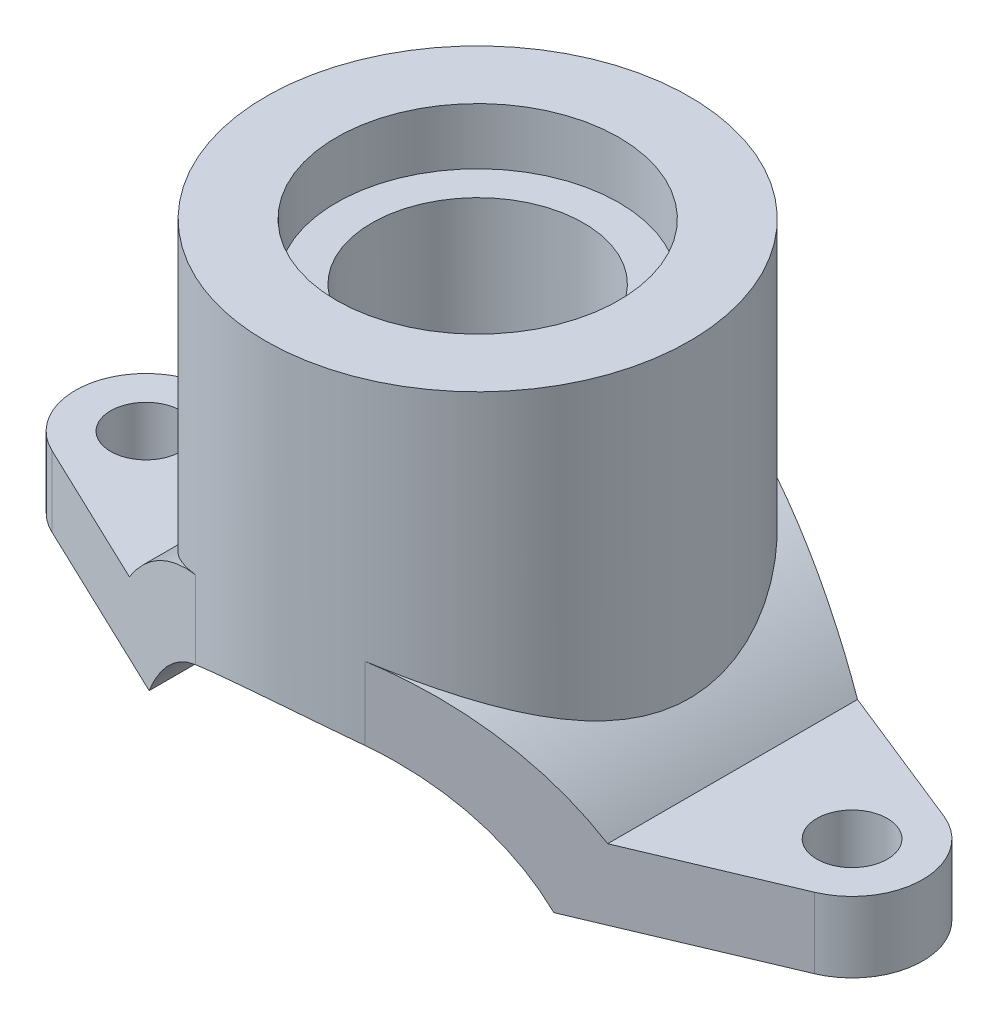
from build123d import *

# Parameters (mm, degrees)
BOSS_EXTRUDE1_DEPTH = 75
SKETCH3_OUTSIDE_W   = 370.368
SKETCH3_OUTSIDE_H   = 220.368
CUT_EXTRUDE1_DEPTH  = 223.162102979
BOSS_EXTRUDE2_REACH = 227
SKETCH4_R           = 75
SKETCH6_R           = 12.5
CUT_EXTRUDE2_DEPTH  = 210.165006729


with BuildPart() as part:
    # Sketch2 → Boss-Extrude1 (new, symmetric)
    with BuildSketch(Plane.XY):
        with BuildLine():
            Line((-150, 0), (-69.84983894, 0))
            ThreePointArc((-69.84983894, 0), (0, 41), (69.84983894, 0))
            Line((69.84983894, 0), (150, 0))
            Line((150, 0), (150, 25))
            Line((150, 25), (83.240615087, 25))
            ThreePointArc((83.240615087, 25), (0, 66), (-83.240615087, 25))
            Line((-83.240615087, 25), (-150, 25))
            Line((-150, 25), (-150, 0))
        make_face()
    extrude(amount=BOSS_EXTRUDE1_DEPTH, both=True)

    # Sketch3 outside → Cut-Extrude1 (cut, through all)
    with BuildSketch(Plane(origin=(0, 66, 75), x_dir=(1, 0, 0), z_dir=(0, 1, 0))):
        with Locations((0, 75)):
            Rectangle(SKETCH3_OUTSIDE_W, SKETCH3_OUTSIDE_H)
        with BuildLine():
            Line((-135.30373924, 98.983518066), (-37.26121772, 143.333715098))
            ThreePointArc((-37.26121772, 143.333715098), (-7.979337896, 149.982299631), (21.563708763, 144.611959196))
            Line((21.563708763, 144.611959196), (134.304569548, 99.403986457))
            ThreePointArc((134.304569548, 99.403986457), (149.998956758, 76.428387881), (134.726959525, 53.169883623))
            Line((134.726959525, 53.169883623), (22.830878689, 5.909651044))
            ThreePointArc((22.830878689, 5.909651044), (-8.056201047, 0.019409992), (-38.643381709, 7.308512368))
            Line((-38.643381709, 7.308512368), (-135.76446057, 53.641783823))
            ThreePointArc((-135.76446057, 53.641783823), (-149.998709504, 76.459627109), (-135.30373924, 98.983518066))
        make_face(mode=Mode.SUBTRACT)
    extrude(amount=-CUT_EXTRUDE1_DEPTH, mode=Mode.SUBTRACT)

    # Sketch4 → Boss-Extrude2 (add, up to next)
    with BuildSketch(Plane(origin=(0, 150, 0), x_dir=(1, 0, 0), z_dir=(0, 1, 0)), mode=Mode.PRIVATE) as boss_extrude2_sk1:
        with Locations(Location((-6.35, 0, 0), (0, 0, 244.495726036))):
            Circle(SKETCH4_R)
    boss_extrude2_tool1 = extrude(boss_extrude2_sk1.sketch, amount=-BOSS_EXTRUDE2_REACH, mode=Mode.PRIVATE) - part.part
    add(boss_extrude2_tool1.solids().sort_by_distance((-6.35, 150, 0))[0])

    # Sketch5 → Cut-Revolve1 (revolve, cut)
    with BuildSketch(Plane.XY, mode=Mode.PRIVATE) as cut_revolve1_sk:
        Polygon((-6.35, 150), (43.65, 150), (43.65, 130), (31.15, 130), (31.15, 20), (-6.35, 20), align=None)
    revolve(cut_revolve1_sk.sketch.rotate(Axis((-6.35, 177.8, 0), (0, -1, 0)), 90), axis=Axis((-6.35, 177.8, 0), (0, -1, 0)), mode=Mode.SUBTRACT)

    # Sketch6 → Cut-Extrude2 (cut, through all)
    with BuildSketch(Plane(origin=(0, 25, 0), x_dir=(1, 0, 0), z_dir=(0, 1, 0))):
        with Locations(Location((-125, 1.205613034, 0), (0, 0, 270))):
            Circle(SKETCH6_R)
        with Locations(Location((124.999999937, 1.2, 0), (0, 0, 270))):
            Circle(SKETCH6_R)
    extrude(amount=-CUT_EXTRUDE2_DEPTH, mode=Mode.SUBTRACT)


solid = part.part
